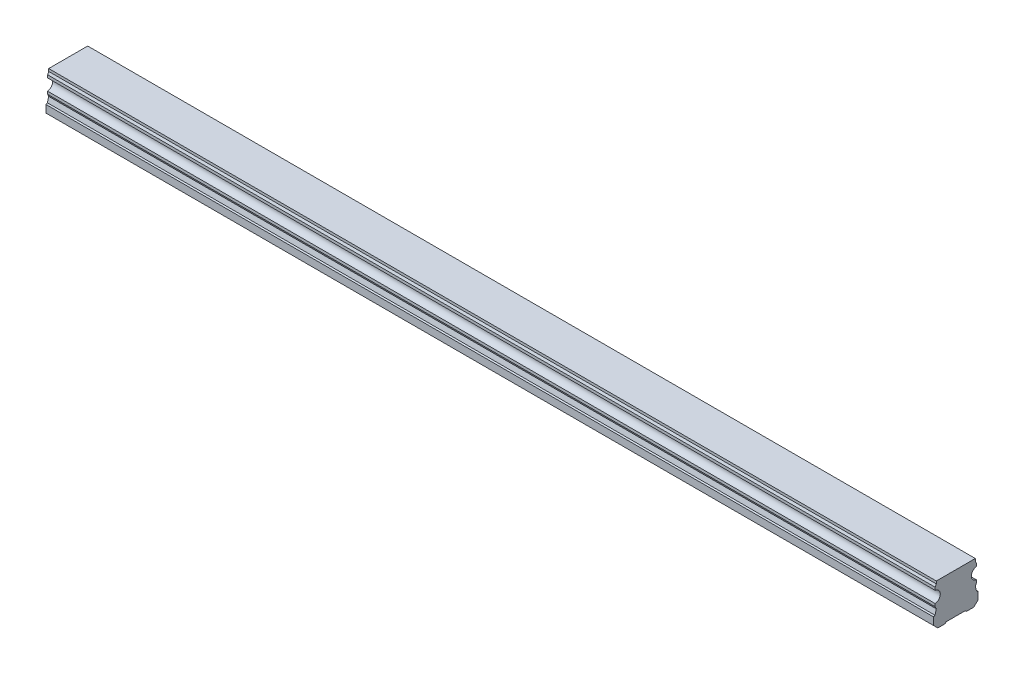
from build123d import *

# Parameters (mm, degrees)
BOSS_EXTRUDE1_DEPTH        = 300
SKETCH3_R                  = 2.5
SKETCH3_R_2                = 2.1
CUT_EXTRUDE3_DEPTH         = 7
SKETCH3_2_R                = 2.1
CUT_EXTRUDE4_DEPTH         = 9.5
CHAMFER1_SIZE              = 0.4
LPATTERN2_COUNT            = 5
LPATTERN2_PITCH            = 60
CHAMFER1_OF_LPATTERN2_SIZE = 0.4


with BuildPart() as part:
    # Sketch1 → Boss-Extrude1 (new body)
    with BuildSketch(Plane(origin=(0, 0, 0), x_dir=(0, 0, -1), z_dir=(1, 0, 0))):
        with BuildLine():
            Line((6.59, 14), (-6.59, 14))
            Line((-6.59, 14), (-6.59, 13.15))
            Line((-6.59, 13.15), (-6.96, 12.356532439))
            Line((-6.96, 12.356532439), (-6.96, 11.435174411))
            ThreePointArc((-6.96, 11.435174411), (-5.25, 9.5), (-6.96, 7.564825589))
            Line((-6.96, 7.564825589), (-6.96, 6.643467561))
            Line((-6.96, 6.643467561), (-6.59, 5.85))
            Line((-6.59, 5.85), (-7.032116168, 4.2))
            Line((-7.032116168, 4.2), (-7.5, 3.929867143))
            Line((-7.5, 3.929867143), (-7.5, 1.4))
            Line((-7.5, 1.4), (-6.1, 0))
            Line((-6.1, 0), (-3.65, 0))
            Line((-3.65, 0), (-3.25, 0.4))
            Line((-3.25, 0.4), (3.25, 0.4))
            Line((3.25, 0.4), (3.65, 0))
            Line((3.65, 0), (6.1, 0))
            Line((6.1, 0), (7.5, 1.4))
            Line((7.5, 1.4), (7.5, 3.929867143))
            Line((7.5, 3.929867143), (7.032116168, 4.2))
            Line((7.032116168, 4.2), (6.59, 5.85))
            Line((6.59, 5.85), (6.96, 6.643467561))
            Line((6.96, 6.643467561), (6.96, 7.564825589))
            ThreePointArc((6.96, 7.564825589), (5.25, 9.5), (6.96, 11.435174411))
            Line((6.96, 11.435174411), (6.96, 12.356532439))
            Line((6.96, 12.356532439), (6.59, 13.15))
            Line((6.59, 13.15), (6.59, 14))
        make_face()
    extrude(amount=BOSS_EXTRUDE1_DEPTH)

    # Sketch3 → Cut-Extrude3 (cut)
    with BuildSketch(Plane.XZ):
        with Locations(Location((30, 0, 0), (0, 0, 270))):
            Circle(SKETCH3_R)
        with Locations(Location((30, 0, 0), (0, 0, 270))):
            Circle(SKETCH3_R_2, mode=Mode.SUBTRACT)
    cut_extrude3 = extrude(amount=-CUT_EXTRUDE3_DEPTH, mode=Mode.SUBTRACT)

    # Sketch3_2 → Cut-Extrude4 (cut)
    with BuildSketch(Plane.XZ):
        with Locations(Location((30, 0, 0), (0, 0, 270))):
            Circle(SKETCH3_2_R)
    cut_extrude4 = extrude(amount=-CUT_EXTRUDE4_DEPTH, mode=Mode.SUBTRACT)

    # Cut-Extrude5 cone 1 section (on through the dimple's axis) → Cut-Extrude5 (revolve, cut)
    with BuildSketch(Plane(origin=(30, 9.5, 0), x_dir=(0, 0, -1), z_dir=(1, 0, 0))):
        Polygon((0, 0), (2.1, 0), (0, 1.212435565), align=None)
    revolve(axis=Axis((30, 9.5, 0), (0, 1, 0)), mode=Mode.SUBTRACT)

    # Chamfer1
    chamfer1_edges = [part.edges().sort_by_distance(p)[0] for p in [
        (30, 0.4, 2.5),
    ]]
    chamfer(chamfer1_edges, length=CHAMFER1_SIZE)

    # LPattern2: Cut-Extrude3, Cut-Extrude4 ×5
    with Locations(*[(i * LPATTERN2_PITCH, 0, 0) for i in range(1, LPATTERN2_COUNT)]):
        add(cut_extrude3, mode=Mode.SUBTRACT)
        add(cut_extrude4, mode=Mode.SUBTRACT)

    # Chamfer1 of LPattern2
    chamfer1_of_lpattern2_edges = [part.edges().sort_by_distance(p)[0] for p in [
        (90, 0.4, 2.5),
        (150, 0.4, 2.5),
        (210, 0.4, 2.5),
        (270, 0.4, 2.5),
    ]]
    chamfer(chamfer1_of_lpattern2_edges, length=CHAMFER1_OF_LPATTERN2_SIZE)


solid = part.part
